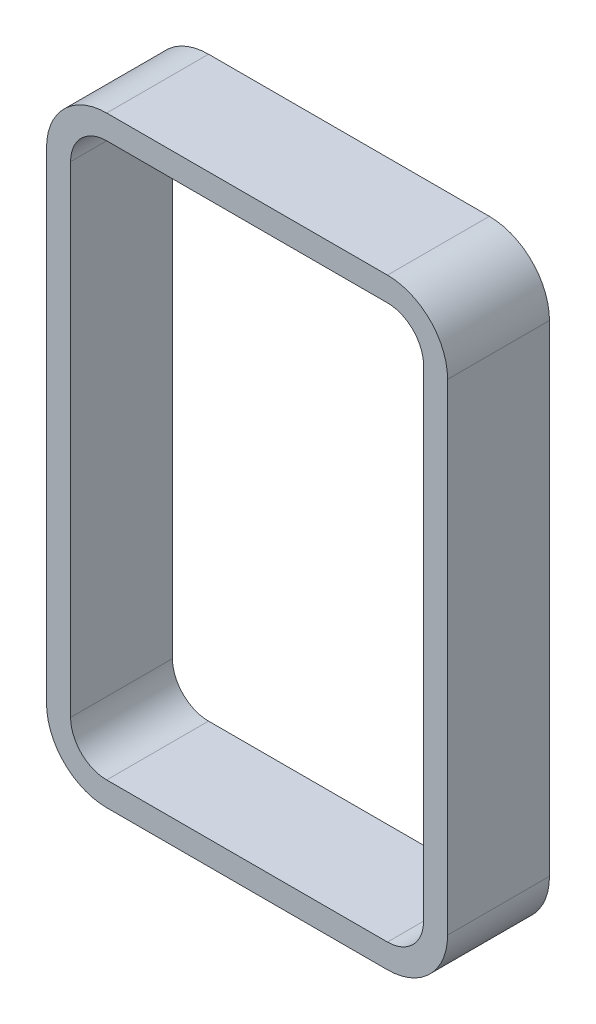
from build123d import *

# Parameters (mm, degrees)
BASESECTION_DEPTH = 12.7


with BuildPart() as part:
    # Sketch1 → BaseSection (new, symmetric)
    with BuildSketch(Plane.XY):
        with BuildLine():
            Line((-35, -75), (35, -75))
            ThreePointArc((35, -75), (45.606601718, -70.606601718), (50, -60))
            Line((50, -60), (50, 60))
            ThreePointArc((50, 60), (45.606601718, 70.606601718), (35, 75))
            Line((35, 75), (-35, 75))
            ThreePointArc((-35, 75), (-45.606601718, 70.606601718), (-50, 60))
            Line((-50, 60), (-50, -60))
            ThreePointArc((-50, -60), (-45.606601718, -70.606601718), (-35, -75))
        make_face()
        with BuildLine():
            Line((-35, 69), (35, 69))
            ThreePointArc((35, 69), (41.363961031, 66.363961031), (44, 60))
            Line((44, 60), (44, -60))
            ThreePointArc((44, -60), (41.363961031, -66.363961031), (35, -69))
            Line((35, -69), (-35, -69))
            ThreePointArc((-35, -69), (-41.363961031, -66.363961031), (-44, -60))
            Line((-44, -60), (-44, 60))
            ThreePointArc((-44, 60), (-41.363961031, 66.363961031), (-35, 69))
        make_face(mode=Mode.SUBTRACT)
    extrude(amount=BASESECTION_DEPTH, both=True)


solid = part.part
